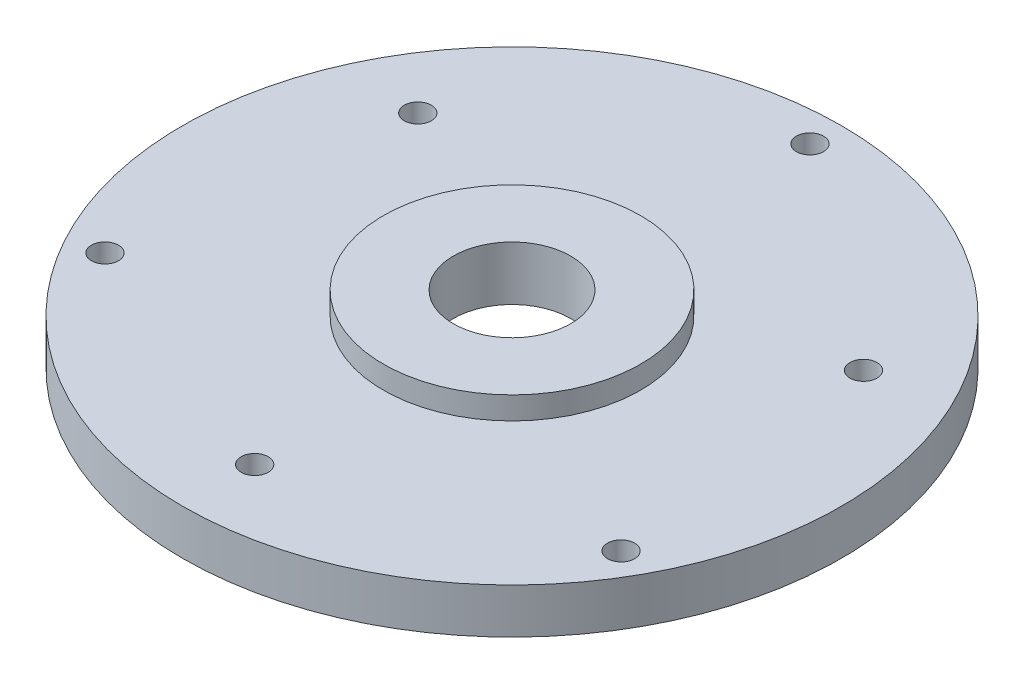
from build123d import *

# Parameters (mm, degrees)
SCHIZZO2_R               = 1.5
TAGLIO_ESTRUSIONE1_DEPTH = 52.860389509
SCHIZZO6_R               = 1.5
TAGLIO_ESTRUSIONE3_DEPTH = 53.160809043


with BuildPart() as part:
    # Schizzo1 → Rivoluzione1 (revolve)
    with BuildSketch(Plane.XY, mode=Mode.PRIVATE) as rivoluzione1_sk:
        Polygon((36.5, 39.385931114), (36.5, 34.385931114), (13, 34.385931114), (13, 35.885931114), (6.5, 35.885931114), (6.5, 41.885931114), (14.25, 41.885931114), (14.25, 39.385931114), align=None)
    revolve(rivoluzione1_sk.sketch.rotate(Axis((0, 0, 0), (0, 1, 0)), 90), axis=Axis((0, 0, 0), (0, 1, 0)))

    # Schizzo2 → Taglio-Estrusione1 (cut, through all)
    with BuildSketch(Plane(origin=(0, 39.385931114, 0), x_dir=(1, 0, 0), z_dir=(0, 1, 0))):
        with Locations(Location((0, 33, 0), (0, 0, 270))):
            Circle(SCHIZZO2_R)
        with Locations(Location((28.578838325, -16.5, 0), (0, 0, 270))):
            Circle(SCHIZZO2_R)
        with Locations(Location((-28.578838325, -16.5, 0), (0, 0, 270))):
            Circle(SCHIZZO2_R)
    extrude(amount=-TAGLIO_ESTRUSIONE1_DEPTH, mode=Mode.SUBTRACT)

    # Schizzo6 → Taglio-Estrusione3 (cut, through all)
    with BuildSketch(Plane(origin=(0, 34.385931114, 0), x_dir=(-1, 0, 0), z_dir=(0, -1, 0))):
        with Locations(Location((0, -28.5, 0), (0, 0, 90))):
            Circle(SCHIZZO6_R)
        with Locations(Location((-24.681724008, 14.25, 0), (0, 0, 90))):
            Circle(SCHIZZO6_R)
        with Locations(Location((24.681724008, 14.25, 0), (0, 0, 90))):
            Circle(SCHIZZO6_R)
    extrude(amount=-TAGLIO_ESTRUSIONE3_DEPTH, mode=Mode.SUBTRACT)


solid = part.part
